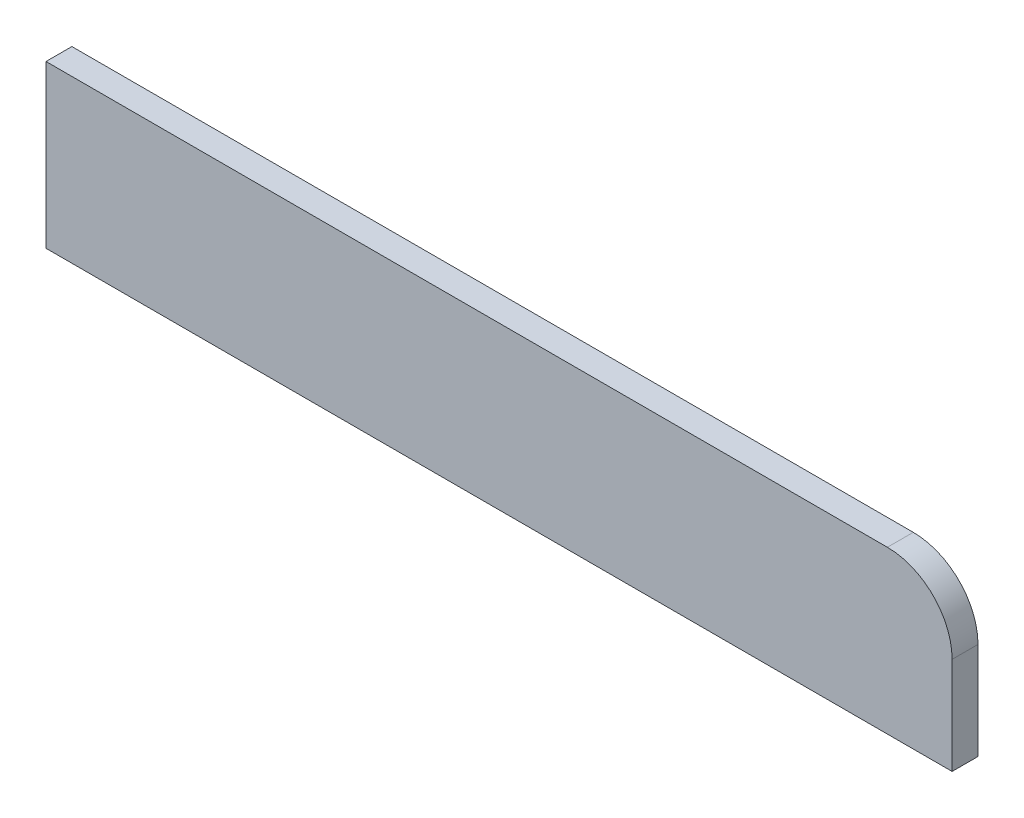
from build123d import *

# Parameters (mm, degrees)
BASE_EXTRUSION_DEPTH = 8


with BuildPart() as part:
    # Esquisse1 → Base-Extrusion (new body)
    with BuildSketch(Plane.XY):
        with BuildLine():
            Line((0, 0), (0, -50))
            Line((0, -50), (280, -50))
            Line((280, -50), (280, -20))
            ThreePointArc((280, -20), (274.142135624, -5.857864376), (260, 0))
            Line((260, 0), (0, 0))
        make_face()
    extrude(amount=BASE_EXTRUSION_DEPTH)


solid = part.part
